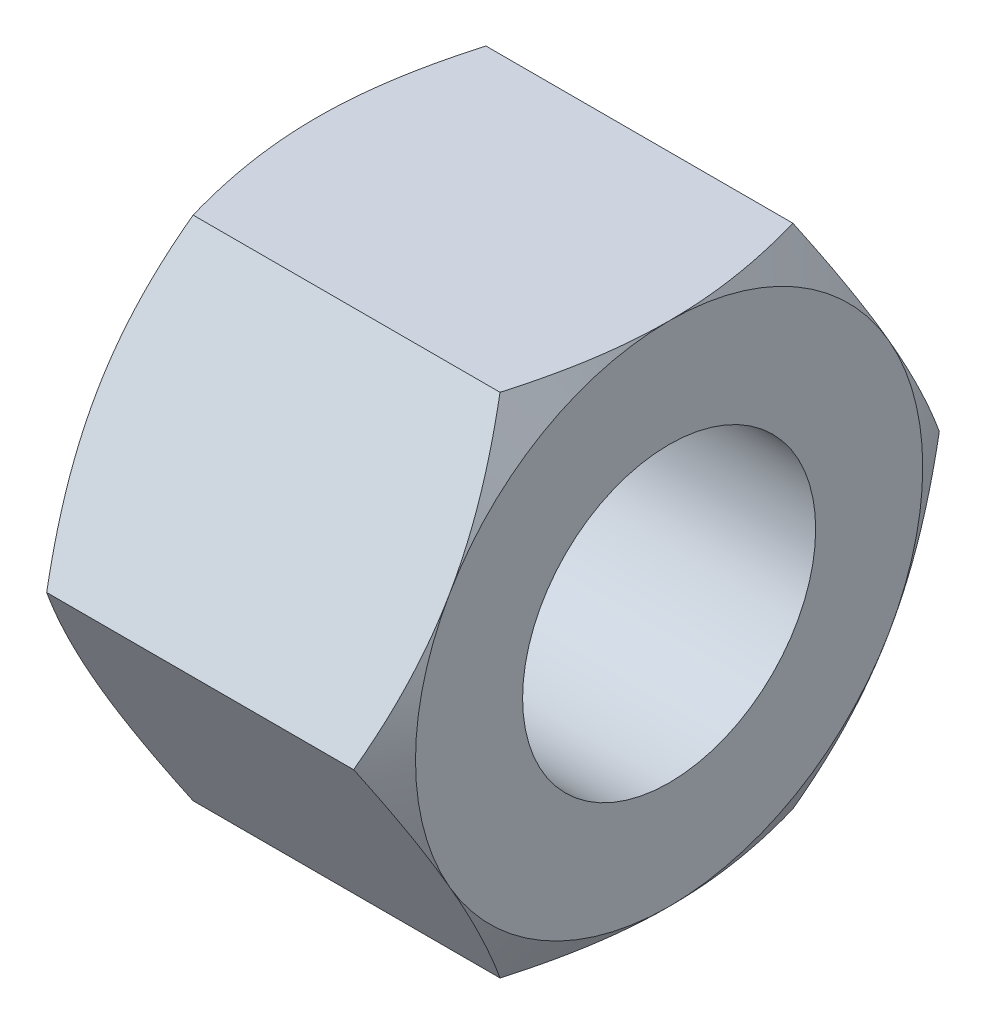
from build123d import *

# Parameters (mm, degrees)
SKETCH_H_OUTSIDE_W = 56.346
SKETCH_H_OUTSIDE_H = 56.346
HEXAGONE_DEPTH     = 39.588219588


with BuildPart() as part:
    # Contour → Base-R_volution (revolve)
    with BuildSketch(Plane.XY, mode=Mode.PRIVATE) as base_r_volution_sk:
        Polygon((0, 10.4), (-25, 10.4), (-25, 18), (-23.39195283, 20.7852194), (-1.60804717, 20.7852194), (0, 18), align=None)
    revolve(base_r_volution_sk.sketch.rotate(Axis((-30, 0, 0), (1, 0, 0)), 90), axis=Axis((-30, 0, 0), (1, 0, 0)))

    # Sketch H outside → Hexagone (cut, through all)
    with BuildSketch(Plane.ZY.offset(25)):
        Rectangle(SKETCH_H_OUTSIDE_W, SKETCH_H_OUTSIDE_H)
        Polygon((20.784609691, 0), (10.392304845, 18), (-10.392304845, 18), (-20.784609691, 0), (-10.392304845, -18), (10.392304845, -18), align=None, mode=Mode.SUBTRACT)
    extrude(amount=-HEXAGONE_DEPTH, mode=Mode.SUBTRACT)


solid = part.part
